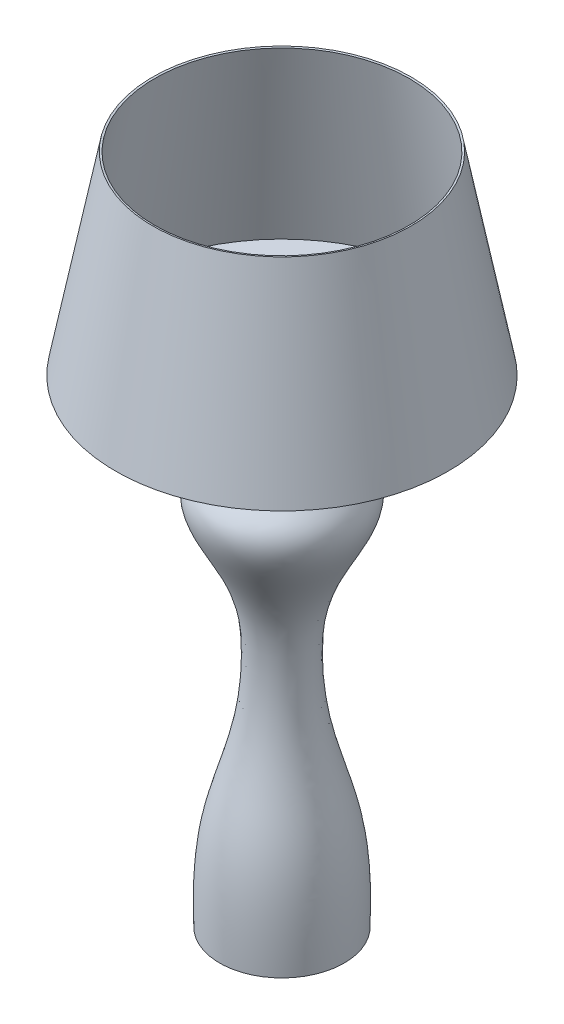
ISO-10303-21;
HEADER;
FILE_DESCRIPTION(('STEP AP214'),'2;1');
FILE_NAME('part.step','',(''),(''),'','','');
FILE_SCHEMA(('AUTOMOTIVE_DESIGN { 1 0 10303 214 1 1 1 1 }'));
ENDSEC;
DATA;
#1=APPLICATION_CONTEXT('core data for automotive mechanical design processes');
#2=APPLICATION_PROTOCOL_DEFINITION('international standard','automotive_design',2000,#1);
#3=PRODUCT_CONTEXT('',#1,'mechanical');
#4=PRODUCT('Part','Part','',(#3));
#5=PRODUCT_RELATED_PRODUCT_CATEGORY('part','',(#4));
#6=PRODUCT_DEFINITION_FORMATION('','',#4);
#7=PRODUCT_DEFINITION_CONTEXT('part definition',#1,'design');
#8=PRODUCT_DEFINITION('design','',#6,#7);
#9=PRODUCT_DEFINITION_SHAPE('','',#8);
#10=(LENGTH_UNIT() NAMED_UNIT(*) SI_UNIT(.MILLI.,.METRE.));
#11=(NAMED_UNIT(*) PLANE_ANGLE_UNIT() SI_UNIT($,.RADIAN.));
#12=(NAMED_UNIT(*) SI_UNIT($,.STERADIAN.) SOLID_ANGLE_UNIT());
#13=UNCERTAINTY_MEASURE_WITH_UNIT(LENGTH_MEASURE(1.E-05),#10,'distance_accuracy_value','');
#14=(GEOMETRIC_REPRESENTATION_CONTEXT(3) GLOBAL_UNCERTAINTY_ASSIGNED_CONTEXT((#13)) GLOBAL_UNIT_ASSIGNED_CONTEXT((#10,
#11,#12)) REPRESENTATION_CONTEXT('',''));
#15=CARTESIAN_POINT('',(0.,0.,0.));
#16=DIRECTION('',(0.,0.,1.));
#17=DIRECTION('',(1.,0.,0.));
#18=AXIS2_PLACEMENT_3D('',#15,#16,#17);
#19=CARTESIAN_POINT('',(1572.97182028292,969.330191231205,0.));
#20=DIRECTION('',(0.,-1.,0.));
#21=DIRECTION('',(0.,0.,-1.));
#22=AXIS2_PLACEMENT_3D('',#19,#20,#21);
#23=CONICAL_SURFACE('',#22,253.870392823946,0.189370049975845);
#24=CARTESIAN_POINT('',(1572.97182028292,1265.76547049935,0.));
#25=DIRECTION('',(0.,-1.,0.));
#26=DIRECTION('',(0.,0.,-1.));
#27=AXIS2_PLACEMENT_3D('',#24,#25,#26);
#28=CIRCLE('',#27,197.053630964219);
#29=CARTESIAN_POINT('',(1572.97182028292,1265.76547049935,-197.053630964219));
#30=VERTEX_POINT('',#29);
#31=EDGE_CURVE('E10',#30,#30,#28,.T.);
#32=ORIENTED_EDGE('',*,*,#31,.F.);
#33=EDGE_LOOP('',(#32));
#34=FACE_BOUND('',#33,.T.);
#35=CARTESIAN_POINT('',(1572.97182028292,969.330191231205,0.));
#36=DIRECTION('',(0.,-1.,0.));
#37=DIRECTION('',(0.,0.,-1.));
#38=AXIS2_PLACEMENT_3D('',#35,#36,#37);
#39=CIRCLE('',#38,253.870392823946);
#40=CARTESIAN_POINT('',(1572.97182028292,969.330191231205,-253.870392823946));
#41=VERTEX_POINT('',#40);
#42=EDGE_CURVE('E73',#41,#41,#39,.T.);
#43=ORIENTED_EDGE('',*,*,#42,.T.);
#44=EDGE_LOOP('',(#43));
#45=FACE_BOUND('',#44,.T.);
#46=ADVANCED_FACE('F33',(#34,#45),#23,.F.);
#47=CARTESIAN_POINT('',(1572.97182028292,1266.33019123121,0.));
#48=DIRECTION('',(0.,1.,0.));
#49=DIRECTION('',(0.,0.,1.));
#50=AXIS2_PLACEMENT_3D('',#47,#48,#49);
#51=CONICAL_SURFACE('',#50,200.,1.38142627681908);
#52=ORIENTED_EDGE('',*,*,#31,.T.);
#53=EDGE_LOOP('',(#52));
#54=FACE_BOUND('',#53,.T.);
#55=CARTESIAN_POINT('',(1572.97182028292,1266.33019123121,0.));
#56=DIRECTION('',(0.,-1.,0.));
#57=DIRECTION('',(0.,0.,-1.));
#58=AXIS2_PLACEMENT_3D('',#55,#56,#57);
#59=CIRCLE('',#58,200.);
#60=CARTESIAN_POINT('',(1572.97182028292,1266.33019123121,-200.));
#61=VERTEX_POINT('',#60);
#62=EDGE_CURVE('E39',#61,#61,#59,.T.);
#63=ORIENTED_EDGE('',*,*,#62,.F.);
#64=EDGE_LOOP('',(#63));
#65=FACE_BOUND('',#64,.T.);
#66=ADVANCED_FACE('F120',(#54,#65),#51,.F.);
#67=CARTESIAN_POINT('',(1572.97182028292,966.330191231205,0.));
#68=DIRECTION('',(0.,-1.,0.));
#69=DIRECTION('',(0.,0.,-1.));
#70=AXIS2_PLACEMENT_3D('',#67,#68,#69);
#71=CONICAL_SURFACE('',#70,257.5,0.189370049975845);
#72=ORIENTED_EDGE('',*,*,#62,.T.);
#73=EDGE_LOOP('',(#72));
#74=FACE_BOUND('',#73,.T.);
#75=CARTESIAN_POINT('',(1572.97182028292,966.330191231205,0.));
#76=DIRECTION('',(0.,-1.,0.));
#77=DIRECTION('',(0.,0.,-1.));
#78=AXIS2_PLACEMENT_3D('',#75,#76,#77);
#79=CIRCLE('',#78,257.5);
#80=CARTESIAN_POINT('',(1572.97182028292,966.330191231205,-257.5));
#81=VERTEX_POINT('',#80);
#82=EDGE_CURVE('E43',#81,#81,#79,.T.);
#83=ORIENTED_EDGE('',*,*,#82,.F.);
#84=EDGE_LOOP('',(#83));
#85=FACE_BOUND('',#84,.T.);
#86=ADVANCED_FACE('F117',(#74,#85),#71,.T.);
#87=CARTESIAN_POINT('',(1565.47182028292,966.330191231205,0.));
#88=DIRECTION('',(0.,-1.,0.));
#89=DIRECTION('',(0.,0.,-1.));
#90=AXIS2_PLACEMENT_3D('',#87,#88,#89);
#91=PLANE('',#90);
#92=ORIENTED_EDGE('',*,*,#82,.T.);
#93=EDGE_LOOP('',(#92));
#94=FACE_BOUND('',#93,.T.);
#95=CARTESIAN_POINT('',(1572.97182028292,966.330191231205,0.));
#96=DIRECTION('',(0.,-1.,0.));
#97=DIRECTION('',(0.,0.,-1.));
#98=AXIS2_PLACEMENT_3D('',#95,#96,#97);
#99=CIRCLE('',#98,7.50000000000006);
#100=CARTESIAN_POINT('',(1572.97182028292,966.330191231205,-7.50000000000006));
#101=VERTEX_POINT('',#100);
#102=EDGE_CURVE('E47',#101,#101,#99,.T.);
#103=ORIENTED_EDGE('',*,*,#102,.F.);
#104=EDGE_LOOP('',(#103));
#105=FACE_BOUND('',#104,.T.);
#106=ADVANCED_FACE('F113',(#94,#105),#91,.T.);
#107=CARTESIAN_POINT('',(1572.97182028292,226.330191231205,0.));
#108=DIRECTION('',(0.,-1.,0.));
#109=DIRECTION('',(0.,0.,-1.));
#110=AXIS2_PLACEMENT_3D('',#107,#108,#109);
#111=CYLINDRICAL_SURFACE('',#110,7.50000000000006);
#112=ORIENTED_EDGE('',*,*,#102,.T.);
#113=EDGE_LOOP('',(#112));
#114=FACE_BOUND('',#113,.T.);
#115=CARTESIAN_POINT('',(1572.97182028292,926.330191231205,0.));
#116=DIRECTION('',(0.,-1.,0.));
#117=DIRECTION('',(0.,0.,-1.));
#118=AXIS2_PLACEMENT_3D('',#115,#116,#117);
#119=CIRCLE('',#118,7.50000000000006);
#120=CARTESIAN_POINT('',(1572.97182028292,926.330191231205,-7.50000000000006));
#121=VERTEX_POINT('',#120);
#122=EDGE_CURVE('E52',#121,#121,#119,.T.);
#123=ORIENTED_EDGE('',*,*,#122,.F.);
#124=EDGE_LOOP('',(#123));
#125=FACE_BOUND('',#124,.T.);
#126=ADVANCED_FACE('F109',(#114,#125),#111,.T.);
#127=CARTESIAN_POINT('',(1521.47182028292,926.330191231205,0.));
#128=DIRECTION('',(0.,1.,0.));
#129=DIRECTION('',(0.,0.,1.));
#130=AXIS2_PLACEMENT_3D('',#127,#128,#129);
#131=PLANE('',#130);
#132=ORIENTED_EDGE('',*,*,#122,.T.);
#133=EDGE_LOOP('',(#132));
#134=FACE_BOUND('',#133,.T.);
#135=CARTESIAN_POINT('',(1572.97182028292,926.330191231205,0.));
#136=DIRECTION('',(0.,-1.,0.));
#137=DIRECTION('',(0.,0.,-1.));
#138=AXIS2_PLACEMENT_3D('',#135,#136,#137);
#139=CIRCLE('',#138,51.4999999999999);
#140=CARTESIAN_POINT('',(1572.97182028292,926.330191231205,-51.4999999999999));
#141=VERTEX_POINT('',#140);
#142=EDGE_CURVE('E55',#141,#141,#139,.T.);
#143=ORIENTED_EDGE('',*,*,#142,.F.);
#144=EDGE_LOOP('',(#143));
#145=FACE_BOUND('',#144,.T.);
#146=ADVANCED_FACE('F105',(#134,#145),#131,.T.);
#147=CARTESIAN_POINT('',(1476.47182028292,226.330191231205,0.));
#148=CARTESIAN_POINT('',(1473.89103879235,314.074519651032,0.));
#149=CARTESIAN_POINT('',(1488.38779230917,407.956974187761,0.));
#150=CARTESIAN_POINT('',(1534.29743135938,526.095091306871,0.));
#151=CARTESIAN_POINT('',(1521.43343834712,721.63694238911,0.));
#152=CARTESIAN_POINT('',(1403.06284002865,816.884965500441,0.));
#153=CARTESIAN_POINT('',(1530.95522185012,882.713549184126,0.));
#154=CARTESIAN_POINT('',(1521.47182028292,926.330191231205,0.));
#155=B_SPLINE_CURVE_WITH_KNOTS('',3,(#147,#148,#149,#150,#151,#152,#153,#154),.UNSPECIFIED.,.F.,
.F.,(4,1,1,1,1,4),(0.,0.246687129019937,0.520734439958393,0.580528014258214,0.844622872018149,
1.),.UNSPECIFIED.);
#156=CARTESIAN_POINT('',(1572.97182028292,226.330191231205,0.));
#157=DIRECTION('',(0.,-1.,0.));
#158=AXIS1_PLACEMENT('',#156,#157);
#159=SURFACE_OF_REVOLUTION('',#155,#158);
#160=ORIENTED_EDGE('',*,*,#142,.T.);
#161=EDGE_LOOP('',(#160));
#162=FACE_BOUND('',#161,.T.);
#163=CARTESIAN_POINT('',(1572.97182028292,226.330191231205,0.));
#164=DIRECTION('',(0.,-1.,0.));
#165=DIRECTION('',(0.,0.,-1.));
#166=AXIS2_PLACEMENT_3D('',#163,#164,#165);
#167=CIRCLE('',#166,96.5);
#168=CARTESIAN_POINT('',(1572.97182028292,226.330191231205,-96.5));
#169=VERTEX_POINT('',#168);
#170=EDGE_CURVE('E58',#169,#169,#167,.T.);
#171=ORIENTED_EDGE('',*,*,#170,.F.);
#172=EDGE_LOOP('',(#171));
#173=FACE_BOUND('',#172,.T.);
#174=ADVANCED_FACE('F101',(#162,#173),#159,.F.);
#175=CARTESIAN_POINT('',(1572.97182028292,226.330191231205,0.));
#176=DIRECTION('',(0.,-1.,0.));
#177=DIRECTION('',(0.,0.,-1.));
#178=AXIS2_PLACEMENT_3D('',#175,#176,#177);
#179=PLANE('',#178);
#180=ORIENTED_EDGE('',*,*,#170,.T.);
#181=EDGE_LOOP('',(#180));
#182=FACE_BOUND('',#181,.T.);
#183=ADVANCED_FACE('F97',(#182),#179,.T.);
#184=CARTESIAN_POINT('',(1572.97182028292,229.330191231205,0.));
#185=DIRECTION('',(0.,-1.,0.));
#186=DIRECTION('',(0.,0.,-1.));
#187=AXIS2_PLACEMENT_3D('',#184,#185,#186);
#188=PLANE('',#187);
#189=CARTESIAN_POINT('',(1572.97182028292,229.330191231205,0.));
#190=DIRECTION('',(0.,-1.,0.));
#191=DIRECTION('',(0.,0.,-1.));
#192=AXIS2_PLACEMENT_3D('',#189,#190,#191);
#193=CIRCLE('',#192,93.5839023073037);
#194=CARTESIAN_POINT('',(1572.97182028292,229.330191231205,-93.5839023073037));
#195=VERTEX_POINT('',#194);
#196=EDGE_CURVE('E61',#195,#195,#193,.T.);
#197=ORIENTED_EDGE('',*,*,#196,.F.);
#198=EDGE_LOOP('',(#197));
#199=FACE_BOUND('',#198,.T.);
#200=ADVANCED_FACE('F92',(#199),#188,.F.);
#201=CARTESIAN_POINT('',(1479.38791797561,229.330191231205,0.));
#202=CARTESIAN_POINT('',(1478.79276169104,251.1184993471,0.));
#203=CARTESIAN_POINT('',(1478.79254649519,270.189340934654,0.));
#204=CARTESIAN_POINT('',(1479.86781467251,304.358661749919,0.));
#205=CARTESIAN_POINT('',(1480.94307738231,319.456702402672,0.));
#206=CARTESIAN_POINT('',(1484.05514677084,347.157646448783,0.));
#207=CARTESIAN_POINT('',(1486.09165619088,359.760949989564,0.));
#208=CARTESIAN_POINT('',(1491.02162664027,383.970033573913,0.));
#209=CARTESIAN_POINT('',(1493.91653926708,395.577494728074,0.));
#210=CARTESIAN_POINT('',(1500.463404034,419.283082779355,0.));
#211=CARTESIAN_POINT('',(1504.10064216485,431.362192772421,0.));
#212=CARTESIAN_POINT('',(1511.40477054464,456.530150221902,0.));
#213=CARTESIAN_POINT('',(1515.07134341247,469.618969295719,0.));
#214=CARTESIAN_POINT('',(1525.05093196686,511.230116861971,0.));
#215=CARTESIAN_POINT('',(1530.33956409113,542.097980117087,0.));
#216=CARTESIAN_POINT('',(1531.56984207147,582.810402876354,0.));
#217=CARTESIAN_POINT('',(1531.64106482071,587.417143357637,0.));
#218=CARTESIAN_POINT('',(1531.64149560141,594.458410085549,0.));
#219=CARTESIAN_POINT('',(1531.62401458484,596.827316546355,0.));
#220=CARTESIAN_POINT('',(1531.55171707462,601.610274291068,0.));
#221=CARTESIAN_POINT('',(1531.49656044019,604.023660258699,0.));
#222=CARTESIAN_POINT('',(1531.11003847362,616.170531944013,0.));
#223=CARTESIAN_POINT('',(1530.44691322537,626.143419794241,0.));
#224=CARTESIAN_POINT('',(1528.61548164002,640.92278045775,0.));
#225=CARTESIAN_POINT('',(1527.8654673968,645.819329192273,0.));
#226=CARTESIAN_POINT('',(1526.49160423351,653.049608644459,0.));
#227=CARTESIAN_POINT('',(1525.99108223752,655.440481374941,0.));
#228=CARTESIAN_POINT('',(1524.90785838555,660.169481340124,0.));
#229=CARTESIAN_POINT('',(1524.32579841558,662.509222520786,0.));
#230=CARTESIAN_POINT('',(1521.23173309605,674.086455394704,0.));
#231=CARTESIAN_POINT('',(1518.1685958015,682.959236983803,0.));
#232=CARTESIAN_POINT('',(1507.92196254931,708.508223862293,0.));
#233=CARTESIAN_POINT('',(1499.6830348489,724.118143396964,0.));
#234=CARTESIAN_POINT('',(1487.99920100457,745.794750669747,0.));
#235=CARTESIAN_POINT('',(1484.21665881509,752.730220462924,0.));
#236=CARTESIAN_POINT('',(1477.33542594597,766.073103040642,0.));
#237=CARTESIAN_POINT('',(1474.2372992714,772.48076005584,0.));
#238=CARTESIAN_POINT('',(1469.17451837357,784.801085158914,0.));
#239=CARTESIAN_POINT('',(1467.21153282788,790.712442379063,0.));
#240=CARTESIAN_POINT('',(1465.42268336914,799.223340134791,0.));
#241=CARTESIAN_POINT('',(1465.01839208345,802.000905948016,0.));
#242=CARTESIAN_POINT('',(1464.63714406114,807.447100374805,0.));
#243=CARTESIAN_POINT('',(1464.65989931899,810.115568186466,0.));
#244=CARTESIAN_POINT('',(1465.17549752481,815.365698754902,0.));
#245=CARTESIAN_POINT('',(1465.66797185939,817.947633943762,0.));
#246=CARTESIAN_POINT('',(1467.17630386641,823.059215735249,0.));
#247=CARTESIAN_POINT('',(1468.19225396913,825.589440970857,0.));
#248=CARTESIAN_POINT('',(1470.16115084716,829.370080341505,0.));
#249=CARTESIAN_POINT('',(1470.89228090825,830.625894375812,0.));
#250=CARTESIAN_POINT('',(1472.51355257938,833.153400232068,0.));
#251=CARTESIAN_POINT('',(1473.40090204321,834.423081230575,0.));
#252=CARTESIAN_POINT('',(1476.26294287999,838.251218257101,0.));
#253=CARTESIAN_POINT('',(1478.43785080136,840.828220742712,0.));
#254=CARTESIAN_POINT('',(1483.14638774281,846.050167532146,0.));
#255=CARTESIAN_POINT('',(1485.6796871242,848.695271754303,0.));
#256=CARTESIAN_POINT('',(1490.92475474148,854.085721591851,0.));
#257=CARTESIAN_POINT('',(1493.63647853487,856.831184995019,0.));
#258=CARTESIAN_POINT('',(1501.77052105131,865.280329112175,0.));
#259=CARTESIAN_POINT('',(1507.19356914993,871.19404026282,0.));
#260=CARTESIAN_POINT('',(1514.24485756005,880.794051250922,0.));
#261=CARTESIAN_POINT('',(1516.41450168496,884.116613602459,0.));
#262=CARTESIAN_POINT('',(1520.19959005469,891.061804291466,0.));
#263=CARTESIAN_POINT('',(1521.81496230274,894.685123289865,0.));
#264=CARTESIAN_POINT('',(1524.28484170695,902.274166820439,0.));
#265=CARTESIAN_POINT('',(1525.13835806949,906.240165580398,0.));
#266=CARTESIAN_POINT('',(1525.87778904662,914.524481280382,0.));
#267=CARTESIAN_POINT('',(1525.7630412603,918.841464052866,0.));
#268=CARTESIAN_POINT('',(1525.07713652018,923.330191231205,0.));
#269=B_SPLINE_CURVE_WITH_KNOTS('',3,(#201,#202,#203,#204,#205,#206,#207,#208,#209,#210,#211,
#212,#213,#214,#215,#216,#217,#218,#219,#220,#221,#222,#223,#224,#225,#226,#227,#228,#229,#230,
#231,#232,#233,#234,#235,#236,#237,#238,#239,#240,#241,#242,#243,#244,#245,#246,#247,#248,#249,
#250,#251,#252,#253,#254,#255,#256,#257,#258,#259,#260,#261,#262,#263,#264,#265,#266,#267,#268),
.UNSPECIFIED.,.F.,.F.,(4,2,2,2,2,2,2,2,2,2,2,2,2,2,2,2,2,2,2,2,2,2,2,2,2,2,2,2,2,2,2,2,2,4),(0.,
0.0624999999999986,0.124999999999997,0.187499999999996,0.249999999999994,0.312499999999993,
0.374999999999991,0.499999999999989,0.515624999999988,0.523437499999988,0.531249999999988,
0.562499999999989,0.578124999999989,0.585937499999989,0.593749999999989,0.62499999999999,
0.68749999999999,0.718749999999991,0.749999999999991,0.781249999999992,0.796874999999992,
0.812499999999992,0.828124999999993,0.843749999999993,0.851562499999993,0.859374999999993,
0.874999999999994,0.890624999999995,0.906249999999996,0.937499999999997,0.953124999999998,
0.968749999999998,0.984374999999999,1.),.UNSPECIFIED.);
#270=CARTESIAN_POINT('',(1572.97182028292,226.330191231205,0.));
#271=DIRECTION('',(0.,-1.,0.));
#272=AXIS1_PLACEMENT('',#270,#271);
#273=SURFACE_OF_REVOLUTION('',#269,#272);
#274=CARTESIAN_POINT('',(1572.97182028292,923.330191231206,0.));
#275=DIRECTION('',(0.,-1.,0.));
#276=DIRECTION('',(0.,0.,-1.));
#277=AXIS2_PLACEMENT_3D('',#274,#275,#276);
#278=CIRCLE('',#277,47.8946837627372);
#279=CARTESIAN_POINT('',(1572.97182028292,923.330191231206,-47.8946837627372));
#280=VERTEX_POINT('',#279);
#281=EDGE_CURVE('E64',#280,#280,#278,.T.);
#282=ORIENTED_EDGE('',*,*,#281,.F.);
#283=EDGE_LOOP('',(#282));
#284=FACE_BOUND('',#283,.T.);
#285=ORIENTED_EDGE('',*,*,#196,.T.);
#286=EDGE_LOOP('',(#285));
#287=FACE_BOUND('',#286,.T.);
#288=ADVANCED_FACE('F87',(#284,#287),#273,.T.);
#289=CARTESIAN_POINT('',(1521.47182028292,923.330191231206,0.));
#290=DIRECTION('',(0.,1.,0.));
#291=DIRECTION('',(0.,0.,1.));
#292=AXIS2_PLACEMENT_3D('',#289,#290,#291);
#293=PLANE('',#292);
#294=CARTESIAN_POINT('',(1572.97182028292,923.330191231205,0.));
#295=DIRECTION('',(0.,-1.,0.));
#296=DIRECTION('',(0.,0.,-1.));
#297=AXIS2_PLACEMENT_3D('',#294,#295,#296);
#298=CIRCLE('',#297,4.50000000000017);
#299=CARTESIAN_POINT('',(1572.97182028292,923.330191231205,-4.50000000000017));
#300=VERTEX_POINT('',#299);
#301=EDGE_CURVE('E67',#300,#300,#298,.T.);
#302=ORIENTED_EDGE('',*,*,#301,.F.);
#303=EDGE_LOOP('',(#302));
#304=FACE_BOUND('',#303,.T.);
#305=ORIENTED_EDGE('',*,*,#281,.T.);
#306=EDGE_LOOP('',(#305));
#307=FACE_BOUND('',#306,.T.);
#308=ADVANCED_FACE('F91',(#304,#307),#293,.F.);
#309=CARTESIAN_POINT('',(1572.97182028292,226.330191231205,0.));
#310=DIRECTION('',(0.,-1.,0.));
#311=DIRECTION('',(0.,0.,-1.));
#312=AXIS2_PLACEMENT_3D('',#309,#310,#311);
#313=CYLINDRICAL_SURFACE('',#312,4.50000000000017);
#314=CARTESIAN_POINT('',(1572.97182028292,969.330191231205,0.));
#315=DIRECTION('',(0.,-1.,0.));
#316=DIRECTION('',(0.,0.,-1.));
#317=AXIS2_PLACEMENT_3D('',#314,#315,#316);
#318=CIRCLE('',#317,4.50000000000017);
#319=CARTESIAN_POINT('',(1572.97182028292,969.330191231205,-4.50000000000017));
#320=VERTEX_POINT('',#319);
#321=EDGE_CURVE('E70',#320,#320,#318,.T.);
#322=ORIENTED_EDGE('',*,*,#321,.F.);
#323=EDGE_LOOP('',(#322));
#324=FACE_BOUND('',#323,.T.);
#325=ORIENTED_EDGE('',*,*,#301,.T.);
#326=EDGE_LOOP('',(#325));
#327=FACE_BOUND('',#326,.T.);
#328=ADVANCED_FACE('F135',(#324,#327),#313,.F.);
#329=CARTESIAN_POINT('',(1565.47182028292,969.330191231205,0.));
#330=DIRECTION('',(0.,-1.,0.));
#331=DIRECTION('',(0.,0.,-1.));
#332=AXIS2_PLACEMENT_3D('',#329,#330,#331);
#333=PLANE('',#332);
#334=ORIENTED_EDGE('',*,*,#42,.F.);
#335=EDGE_LOOP('',(#334));
#336=FACE_BOUND('',#335,.T.);
#337=ORIENTED_EDGE('',*,*,#321,.T.);
#338=EDGE_LOOP('',(#337));
#339=FACE_BOUND('',#338,.T.);
#340=ADVANCED_FACE('F132',(#336,#339),#333,.F.);
#341=CLOSED_SHELL('',(#46,#66,#86,#106,#126,#146,#174,#183,#200,#288,#308,#328,#340));
#342=MANIFOLD_SOLID_BREP('B2',#341);
#343=ADVANCED_BREP_SHAPE_REPRESENTATION('',(#18,#342),#14);
#344=SHAPE_DEFINITION_REPRESENTATION(#9,#343);
ENDSEC;
END-ISO-10303-21;
